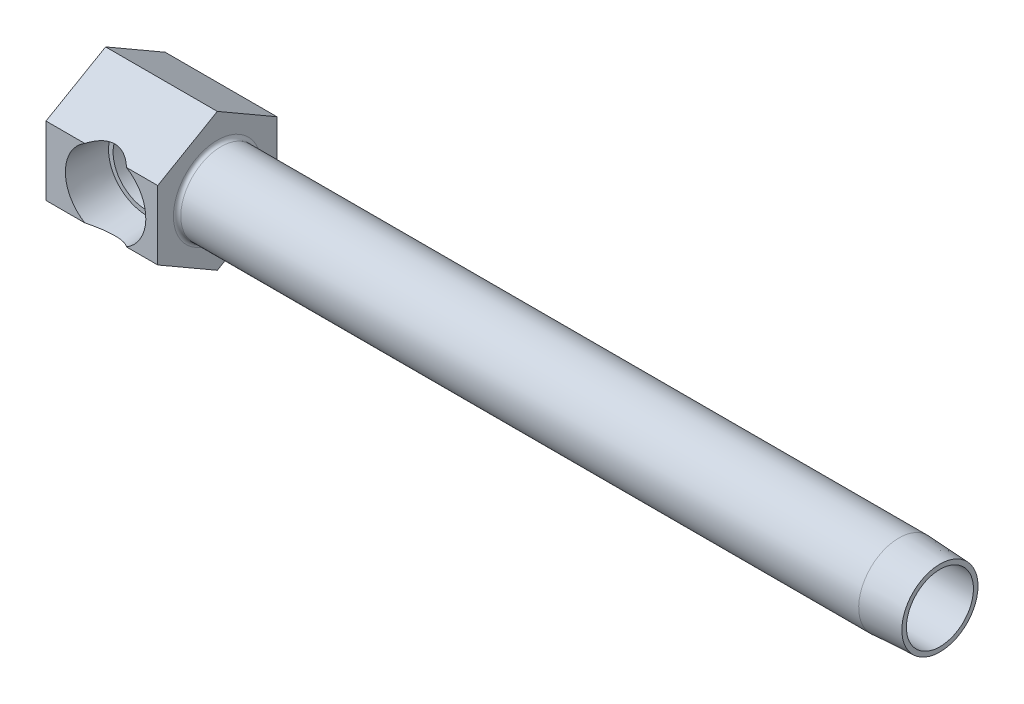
ISO-10303-21;
HEADER;
FILE_DESCRIPTION(('STEP AP214'),'2;1');
FILE_NAME('part.step','',(''),(''),'','','');
FILE_SCHEMA(('AUTOMOTIVE_DESIGN { 1 0 10303 214 1 1 1 1 }'));
ENDSEC;
DATA;
#1=APPLICATION_CONTEXT('core data for automotive mechanical design processes');
#2=APPLICATION_PROTOCOL_DEFINITION('international standard','automotive_design',2000,#1);
#3=PRODUCT_CONTEXT('',#1,'mechanical');
#4=PRODUCT('Part','Part','',(#3));
#5=PRODUCT_RELATED_PRODUCT_CATEGORY('part','',(#4));
#6=PRODUCT_DEFINITION_FORMATION('','',#4);
#7=PRODUCT_DEFINITION_CONTEXT('part definition',#1,'design');
#8=PRODUCT_DEFINITION('design','',#6,#7);
#9=PRODUCT_DEFINITION_SHAPE('','',#8);
#10=(LENGTH_UNIT() NAMED_UNIT(*) SI_UNIT(.MILLI.,.METRE.));
#11=(NAMED_UNIT(*) PLANE_ANGLE_UNIT() SI_UNIT($,.RADIAN.));
#12=(NAMED_UNIT(*) SI_UNIT($,.STERADIAN.) SOLID_ANGLE_UNIT());
#13=UNCERTAINTY_MEASURE_WITH_UNIT(LENGTH_MEASURE(1.E-05),#10,'distance_accuracy_value','');
#14=(GEOMETRIC_REPRESENTATION_CONTEXT(3) GLOBAL_UNCERTAINTY_ASSIGNED_CONTEXT((#13)) GLOBAL_UNIT_ASSIGNED_CONTEXT((#10,
#11,#12)) REPRESENTATION_CONTEXT('',''));
#15=CARTESIAN_POINT('',(0.,0.,0.));
#16=DIRECTION('',(0.,0.,1.));
#17=DIRECTION('',(1.,0.,0.));
#18=AXIS2_PLACEMENT_3D('',#15,#16,#17);
#19=CARTESIAN_POINT('',(63.5,0.,12.7));
#20=DIRECTION('',(-1.,0.,0.));
#21=DIRECTION('',(0.,-1.,0.));
#22=AXIS2_PLACEMENT_3D('',#19,#20,#21);
#23=CYLINDRICAL_SURFACE('',#22,8.5725);
#24=CARTESIAN_POINT('',(24.5999,0.,12.7));
#25=DIRECTION('',(-1.,0.,0.));
#26=DIRECTION('',(0.,-1.,0.));
#27=AXIS2_PLACEMENT_3D('',#24,#25,#26);
#28=CIRCLE('',#27,8.5725);
#29=CARTESIAN_POINT('',(24.5999,-8.57249999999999,12.7));
#30=VERTEX_POINT('',#29);
#31=EDGE_CURVE('E22',#30,#30,#28,.F.);
#32=ORIENTED_EDGE('',*,*,#31,.T.);
#33=EDGE_LOOP('',(#32));
#34=FACE_BOUND('',#33,.T.);
#35=CARTESIAN_POINT('',(169.0624,0.,12.7));
#36=DIRECTION('',(1.,0.,0.));
#37=DIRECTION('',(0.,0.,-1.));
#38=AXIS2_PLACEMENT_3D('',#35,#36,#37);
#39=CIRCLE('',#38,8.5725);
#40=CARTESIAN_POINT('',(169.0624,0.,4.1275));
#41=VERTEX_POINT('',#40);
#42=EDGE_CURVE('E153',#41,#41,#39,.T.);
#43=ORIENTED_EDGE('',*,*,#42,.F.);
#44=EDGE_LOOP('',(#43));
#45=FACE_BOUND('',#44,.T.);
#46=ADVANCED_FACE('F15',(#34,#45),#23,.T.);
#47=CARTESIAN_POINT('',(23.8125,14.6646968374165,12.7));
#48=DIRECTION('',(0.,-0.866025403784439,-0.5));
#49=DIRECTION('',(0.,0.5,-0.866025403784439));
#50=AXIS2_PLACEMENT_3D('',#47,#48,#49);
#51=PLANE('',#50);
#52=CARTESIAN_POINT('',(12.7,-0.84553451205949,39.56450873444));
#53=DIRECTION('',(0.,-0.866025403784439,-0.5));
#54=DIRECTION('',(0.,-0.5,0.866025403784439));
#55=AXIS2_PLACEMENT_3D('',#52,#53,#54);
#56=ELLIPSE('',#55,18.6296608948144,9.27637524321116);
#57=CARTESIAN_POINT('',(17.1412186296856,7.33234841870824,25.4));
#58=VERTEX_POINT('',#57);
#59=CARTESIAN_POINT('',(8.25878137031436,7.33234841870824,25.4));
#60=VERTEX_POINT('',#59);
#61=EDGE_CURVE('E232',#58,#60,#56,.F.);
#62=ORIENTED_EDGE('',*,*,#61,.F.);
#63=DIRECTION('',(-1.,0.,0.));
#64=VECTOR('',#63,1.);
#65=CARTESIAN_POINT('',(23.8125,7.33234841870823,25.4));
#66=LINE('',#65,#64);
#67=CARTESIAN_POINT('',(23.8125,7.33234841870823,25.4));
#68=VERTEX_POINT('',#67);
#69=EDGE_CURVE('E202',#68,#58,#66,.T.);
#70=ORIENTED_EDGE('',*,*,#69,.F.);
#71=DIRECTION('',(0.,-0.5,0.866025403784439));
#72=VECTOR('',#71,1.);
#73=CARTESIAN_POINT('',(23.8125,14.6646968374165,12.7));
#74=LINE('',#73,#72);
#75=CARTESIAN_POINT('',(23.8125,14.6646968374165,12.7));
#76=VERTEX_POINT('',#75);
#77=EDGE_CURVE('E222',#76,#68,#74,.T.);
#78=ORIENTED_EDGE('',*,*,#77,.F.);
#79=DIRECTION('',(-1.,0.,0.));
#80=VECTOR('',#79,1.);
#81=CARTESIAN_POINT('',(23.8125,14.6646968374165,12.7));
#82=LINE('',#81,#80);
#83=CARTESIAN_POINT('',(0.,14.6646968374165,12.7));
#84=VERTEX_POINT('',#83);
#85=EDGE_CURVE('E199',#76,#84,#82,.T.);
#86=ORIENTED_EDGE('',*,*,#85,.T.);
#87=DIRECTION('',(0.,-0.5,0.866025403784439));
#88=VECTOR('',#87,1.);
#89=CARTESIAN_POINT('',(0.,14.6646968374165,12.7));
#90=LINE('',#89,#88);
#91=CARTESIAN_POINT('',(0.,7.33234841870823,25.4));
#92=VERTEX_POINT('',#91);
#93=EDGE_CURVE('E239',#84,#92,#90,.T.);
#94=ORIENTED_EDGE('',*,*,#93,.T.);
#95=EDGE_CURVE('E205',#60,#92,#66,.T.);
#96=ORIENTED_EDGE('',*,*,#95,.F.);
#97=EDGE_LOOP('',(#62,#70,#78,#86,#94,#96));
#98=FACE_BOUND('',#97,.T.);
#99=ADVANCED_FACE('F173',(#98),#51,.F.);
#100=CARTESIAN_POINT('',(23.8125,7.33234841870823,25.4));
#101=DIRECTION('',(0.,0.,-1.));
#102=DIRECTION('',(-1.,0.,0.));
#103=AXIS2_PLACEMENT_3D('',#100,#101,#102);
#104=PLANE('',#103);
#105=CARTESIAN_POINT('',(12.7,0.,25.4));
#106=DIRECTION('',(0.,0.,-1.));
#107=DIRECTION('',(-1.,0.,0.));
#108=AXIS2_PLACEMENT_3D('',#105,#106,#107);
#109=CIRCLE('',#108,8.5725);
#110=CARTESIAN_POINT('',(17.1412186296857,-7.33234841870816,25.4));
#111=VERTEX_POINT('',#110);
#112=EDGE_CURVE('E249',#58,#111,#109,.T.);
#113=ORIENTED_EDGE('',*,*,#112,.T.);
#114=DIRECTION('',(-1.,0.,0.));
#115=VECTOR('',#114,1.);
#116=CARTESIAN_POINT('',(23.8125,-7.33234841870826,25.4));
#117=LINE('',#116,#115);
#118=CARTESIAN_POINT('',(23.8125,-7.33234841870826,25.4));
#119=VERTEX_POINT('',#118);
#120=EDGE_CURVE('E206',#119,#111,#117,.T.);
#121=ORIENTED_EDGE('',*,*,#120,.F.);
#122=DIRECTION('',(0.,-1.,0.));
#123=VECTOR('',#122,1.);
#124=CARTESIAN_POINT('',(23.8125,7.33234841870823,25.4));
#125=LINE('',#124,#123);
#126=EDGE_CURVE('E220',#68,#119,#125,.T.);
#127=ORIENTED_EDGE('',*,*,#126,.F.);
#128=ORIENTED_EDGE('',*,*,#69,.T.);
#129=EDGE_LOOP('',(#113,#121,#127,#128));
#130=FACE_BOUND('',#129,.T.);
#131=ADVANCED_FACE('F179',(#130),#104,.F.);
#132=CARTESIAN_POINT('',(8.25878137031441,-7.33234841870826,25.4));
#133=VERTEX_POINT('',#132);
#134=EDGE_CURVE('E36',#133,#60,#109,.T.);
#135=ORIENTED_EDGE('',*,*,#134,.T.);
#136=ORIENTED_EDGE('',*,*,#95,.T.);
#137=DIRECTION('',(0.,-1.,0.));
#138=VECTOR('',#137,1.);
#139=CARTESIAN_POINT('',(0.,7.33234841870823,25.4));
#140=LINE('',#139,#138);
#141=CARTESIAN_POINT('',(0.,-7.33234841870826,25.4));
#142=VERTEX_POINT('',#141);
#143=EDGE_CURVE('E235',#92,#142,#140,.T.);
#144=ORIENTED_EDGE('',*,*,#143,.T.);
#145=EDGE_CURVE('E209',#133,#142,#117,.T.);
#146=ORIENTED_EDGE('',*,*,#145,.F.);
#147=EDGE_LOOP('',(#135,#136,#144,#146));
#148=FACE_BOUND('',#147,.T.);
#149=ADVANCED_FACE('F285',(#148),#104,.F.);
#150=CARTESIAN_POINT('',(23.8125,-7.33234841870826,25.4));
#151=DIRECTION('',(0.,0.86602540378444,-0.5));
#152=DIRECTION('',(0.,0.5,0.86602540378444));
#153=AXIS2_PLACEMENT_3D('',#150,#151,#152);
#154=PLANE('',#153);
#155=CARTESIAN_POINT('',(12.7,0.845534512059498,39.5645087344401));
#156=DIRECTION('',(0.,0.86602540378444,-0.5));
#157=DIRECTION('',(0.,0.5,0.86602540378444));
#158=AXIS2_PLACEMENT_3D('',#155,#156,#157);
#159=ELLIPSE('',#158,18.6296608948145,9.27637524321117);
#160=EDGE_CURVE('E10',#133,#111,#159,.F.);
#161=ORIENTED_EDGE('',*,*,#160,.F.);
#162=ORIENTED_EDGE('',*,*,#145,.T.);
#163=DIRECTION('',(0.,-0.5,-0.86602540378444));
#164=VECTOR('',#163,1.);
#165=CARTESIAN_POINT('',(0.,-7.33234841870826,25.4));
#166=LINE('',#165,#164);
#167=CARTESIAN_POINT('',(0.,-14.6646968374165,12.7));
#168=VERTEX_POINT('',#167);
#169=EDGE_CURVE('E218',#142,#168,#166,.T.);
#170=ORIENTED_EDGE('',*,*,#169,.T.);
#171=DIRECTION('',(-1.,0.,0.));
#172=VECTOR('',#171,1.);
#173=CARTESIAN_POINT('',(23.8125,-14.6646968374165,12.7));
#174=LINE('',#173,#172);
#175=CARTESIAN_POINT('',(23.8125,-14.6646968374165,12.7));
#176=VERTEX_POINT('',#175);
#177=EDGE_CURVE('E210',#176,#168,#174,.T.);
#178=ORIENTED_EDGE('',*,*,#177,.F.);
#179=DIRECTION('',(0.,-0.5,-0.86602540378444));
#180=VECTOR('',#179,1.);
#181=CARTESIAN_POINT('',(23.8125,-7.33234841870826,25.4));
#182=LINE('',#181,#180);
#183=EDGE_CURVE('E213',#119,#176,#182,.T.);
#184=ORIENTED_EDGE('',*,*,#183,.F.);
#185=ORIENTED_EDGE('',*,*,#120,.T.);
#186=EDGE_LOOP('',(#161,#162,#170,#178,#184,#185));
#187=FACE_BOUND('',#186,.T.);
#188=ADVANCED_FACE('F281',(#187),#154,.F.);
#189=CARTESIAN_POINT('',(23.8125,-14.6646968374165,12.7));
#190=DIRECTION('',(0.,0.866025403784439,0.5));
#191=DIRECTION('',(0.,-0.5,0.866025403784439));
#192=AXIS2_PLACEMENT_3D('',#189,#190,#191);
#193=PLANE('',#192);
#194=DIRECTION('',(0.,0.5,-0.866025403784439));
#195=VECTOR('',#194,1.);
#196=CARTESIAN_POINT('',(0.,-14.6646968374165,12.7));
#197=LINE('',#196,#195);
#198=CARTESIAN_POINT('',(0.,-7.33234841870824,0.));
#199=VERTEX_POINT('',#198);
#200=EDGE_CURVE('E227',#168,#199,#197,.T.);
#201=ORIENTED_EDGE('',*,*,#200,.T.);
#202=DIRECTION('',(-1.,0.,0.));
#203=VECTOR('',#202,1.);
#204=CARTESIAN_POINT('',(23.8125,-7.33234841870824,0.));
#205=LINE('',#204,#203);
#206=CARTESIAN_POINT('',(23.8125,-7.33234841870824,0.));
#207=VERTEX_POINT('',#206);
#208=EDGE_CURVE('E191',#207,#199,#205,.T.);
#209=ORIENTED_EDGE('',*,*,#208,.F.);
#210=DIRECTION('',(0.,0.5,-0.866025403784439));
#211=VECTOR('',#210,1.);
#212=CARTESIAN_POINT('',(23.8125,-14.6646968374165,12.7));
#213=LINE('',#212,#211);
#214=EDGE_CURVE('E214',#176,#207,#213,.T.);
#215=ORIENTED_EDGE('',*,*,#214,.F.);
#216=ORIENTED_EDGE('',*,*,#177,.T.);
#217=EDGE_LOOP('',(#201,#209,#215,#216));
#218=FACE_BOUND('',#217,.T.);
#219=ADVANCED_FACE('F284',(#218),#193,.F.);
#220=CARTESIAN_POINT('',(23.8125,-7.33234841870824,0.));
#221=DIRECTION('',(0.,0.,1.));
#222=DIRECTION('',(0.,-1.,0.));
#223=AXIS2_PLACEMENT_3D('',#220,#221,#222);
#224=PLANE('',#223);
#225=DIRECTION('',(0.,1.,0.));
#226=VECTOR('',#225,1.);
#227=CARTESIAN_POINT('',(0.,-7.33234841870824,0.));
#228=LINE('',#227,#226);
#229=CARTESIAN_POINT('',(0.,7.33234841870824,0.));
#230=VERTEX_POINT('',#229);
#231=EDGE_CURVE('E231',#199,#230,#228,.T.);
#232=ORIENTED_EDGE('',*,*,#231,.T.);
#233=DIRECTION('',(-1.,0.,0.));
#234=VECTOR('',#233,1.);
#235=CARTESIAN_POINT('',(23.8125,7.33234841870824,0.));
#236=LINE('',#235,#234);
#237=CARTESIAN_POINT('',(23.8125,7.33234841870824,0.));
#238=VERTEX_POINT('',#237);
#239=EDGE_CURVE('E196',#238,#230,#236,.T.);
#240=ORIENTED_EDGE('',*,*,#239,.F.);
#241=DIRECTION('',(0.,1.,0.));
#242=VECTOR('',#241,1.);
#243=CARTESIAN_POINT('',(23.8125,-7.33234841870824,0.));
#244=LINE('',#243,#242);
#245=EDGE_CURVE('E217',#207,#238,#244,.T.);
#246=ORIENTED_EDGE('',*,*,#245,.F.);
#247=ORIENTED_EDGE('',*,*,#208,.T.);
#248=EDGE_LOOP('',(#232,#240,#246,#247));
#249=FACE_BOUND('',#248,.T.);
#250=ADVANCED_FACE('F292',(#249),#224,.F.);
#251=CARTESIAN_POINT('',(23.8125,7.33234841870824,0.));
#252=DIRECTION('',(0.,-0.866025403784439,0.5));
#253=DIRECTION('',(0.,-0.5,-0.866025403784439));
#254=AXIS2_PLACEMENT_3D('',#251,#252,#253);
#255=PLANE('',#254);
#256=DIRECTION('',(0.,0.5,0.866025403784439));
#257=VECTOR('',#256,1.);
#258=CARTESIAN_POINT('',(0.,7.33234841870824,0.));
#259=LINE('',#258,#257);
#260=EDGE_CURVE('E243',#230,#84,#259,.T.);
#261=ORIENTED_EDGE('',*,*,#260,.T.);
#262=ORIENTED_EDGE('',*,*,#85,.F.);
#263=DIRECTION('',(0.,0.5,0.866025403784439));
#264=VECTOR('',#263,1.);
#265=CARTESIAN_POINT('',(23.8125,7.33234841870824,0.));
#266=LINE('',#265,#264);
#267=EDGE_CURVE('E224',#238,#76,#266,.T.);
#268=ORIENTED_EDGE('',*,*,#267,.F.);
#269=ORIENTED_EDGE('',*,*,#239,.T.);
#270=EDGE_LOOP('',(#261,#262,#268,#269));
#271=FACE_BOUND('',#270,.T.);
#272=ADVANCED_FACE('F279',(#271),#255,.F.);
#273=CARTESIAN_POINT('',(23.8125,-21.9970452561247,25.4));
#274=DIRECTION('',(-1.,0.,0.));
#275=DIRECTION('',(0.,-1.,0.));
#276=AXIS2_PLACEMENT_3D('',#273,#274,#275);
#277=PLANE('',#276);
#278=CARTESIAN_POINT('',(23.8125,0.,12.7));
#279=DIRECTION('',(-1.,0.,0.));
#280=DIRECTION('',(0.,-1.,0.));
#281=AXIS2_PLACEMENT_3D('',#278,#279,#280);
#282=CIRCLE('',#281,9.3599);
#283=CARTESIAN_POINT('',(23.8125,-9.35989999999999,12.7));
#284=VERTEX_POINT('',#283);
#285=EDGE_CURVE('E189',#284,#284,#282,.T.);
#286=ORIENTED_EDGE('',*,*,#285,.T.);
#287=EDGE_LOOP('',(#286));
#288=FACE_BOUND('',#287,.T.);
#289=ORIENTED_EDGE('',*,*,#214,.T.);
#290=ORIENTED_EDGE('',*,*,#245,.T.);
#291=ORIENTED_EDGE('',*,*,#267,.T.);
#292=ORIENTED_EDGE('',*,*,#77,.T.);
#293=ORIENTED_EDGE('',*,*,#126,.T.);
#294=ORIENTED_EDGE('',*,*,#183,.T.);
#295=EDGE_LOOP('',(#289,#290,#291,#292,#293,#294));
#296=FACE_BOUND('',#295,.T.);
#297=ADVANCED_FACE('F275',(#288,#296),#277,.F.);
#298=CARTESIAN_POINT('',(0.,-21.9970452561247,25.4));
#299=DIRECTION('',(-1.,0.,0.));
#300=DIRECTION('',(0.,-1.,0.));
#301=AXIS2_PLACEMENT_3D('',#298,#299,#300);
#302=PLANE('',#301);
#303=ORIENTED_EDGE('',*,*,#200,.F.);
#304=ORIENTED_EDGE('',*,*,#169,.F.);
#305=ORIENTED_EDGE('',*,*,#143,.F.);
#306=ORIENTED_EDGE('',*,*,#93,.F.);
#307=ORIENTED_EDGE('',*,*,#260,.F.);
#308=ORIENTED_EDGE('',*,*,#231,.F.);
#309=EDGE_LOOP('',(#303,#304,#305,#306,#307,#308));
#310=FACE_BOUND('',#309,.T.);
#311=ADVANCED_FACE('F272',(#310),#302,.T.);
#312=CARTESIAN_POINT('',(24.5999,0.,12.7));
#313=DIRECTION('',(-1.,0.,0.));
#314=DIRECTION('',(0.,-1.,0.));
#315=AXIS2_PLACEMENT_3D('',#312,#313,#314);
#316=TOROIDAL_SURFACE('',#315,9.3599,0.7874);
#317=ORIENTED_EDGE('',*,*,#31,.F.);
#318=EDGE_LOOP('',(#317));
#319=FACE_BOUND('',#318,.T.);
#320=ORIENTED_EDGE('',*,*,#285,.F.);
#321=EDGE_LOOP('',(#320));
#322=FACE_BOUND('',#321,.T.);
#323=ADVANCED_FACE('F269',(#319,#322),#316,.F.);
#324=CARTESIAN_POINT('',(12.7,0.,25.4));
#325=DIRECTION('',(0.,0.,1.));
#326=DIRECTION('',(1.,0.,0.));
#327=AXIS2_PLACEMENT_3D('',#324,#325,#326);
#328=CONICAL_SURFACE('',#327,8.5725,0.0523598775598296);
#329=CARTESIAN_POINT('',(18.2237788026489,-5.94425228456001,16.6622));
#330=CARTESIAN_POINT('',(18.2916176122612,-5.88732299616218,16.7476009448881));
#331=CARTESIAN_POINT('',(18.3592795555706,-5.82850059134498,16.8318676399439));
#332=CARTESIAN_POINT('',(18.4939968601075,-5.70702027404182,16.9981035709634));
#333=CARTESIAN_POINT('',(18.5610521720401,-5.64436205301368,17.0800726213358));
#334=CARTESIAN_POINT('',(18.761107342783,-5.45038497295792,17.3227058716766));
#335=CARTESIAN_POINT('',(18.8927964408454,-5.31322998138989,17.479846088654));
#336=CARTESIAN_POINT('',(19.1518580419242,-5.0216447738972,17.785397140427));
#337=CARTESIAN_POINT('',(19.2791735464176,-4.8670541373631,17.933703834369));
#338=CARTESIAN_POINT('',(19.5257752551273,-4.5416930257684,18.2184184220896));
#339=CARTESIAN_POINT('',(19.6450670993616,-4.37093412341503,18.35483469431));
#340=CARTESIAN_POINT('',(19.9295445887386,-3.92497659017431,18.6779693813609));
#341=CARTESIAN_POINT('',(20.0885588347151,-3.63961711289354,18.8565618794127));
#342=CARTESIAN_POINT('',(20.3031266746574,-3.18637161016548,19.0960411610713));
#343=CARTESIAN_POINT('',(20.3705741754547,-3.03133869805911,19.1710418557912));
#344=CARTESIAN_POINT('',(20.4965477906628,-2.71316594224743,19.3107517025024));
#345=CARTESIAN_POINT('',(20.5550753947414,-2.55002745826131,19.3754625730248));
#346=CARTESIAN_POINT('',(20.6538405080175,-2.24208944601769,19.4844409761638));
#347=CARTESIAN_POINT('',(20.6955064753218,-2.09831594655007,19.5303217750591));
#348=CARTESIAN_POINT('',(20.7709604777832,-1.80624508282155,19.6132970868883));
#349=CARTESIAN_POINT('',(20.8047499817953,-1.65794856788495,19.6503932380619));
#350=CARTESIAN_POINT('',(20.8638747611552,-1.35762804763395,19.7152415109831));
#351=CARTESIAN_POINT('',(20.8892082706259,-1.20560327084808,19.7429916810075));
#352=CARTESIAN_POINT('',(20.9309344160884,-0.898862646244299,19.7886706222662));
#353=CARTESIAN_POINT('',(20.9473269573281,-0.744146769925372,19.8065992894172));
#354=CARTESIAN_POINT('',(20.9708773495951,-0.43270553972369,19.8323499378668));
#355=CARTESIAN_POINT('',(20.9780075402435,-0.275975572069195,19.8401416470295));
#356=CARTESIAN_POINT('',(20.9827943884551,0.0378027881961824,19.8453730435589));
#357=CARTESIAN_POINT('',(20.9804510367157,0.194851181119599,19.8428127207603));
#358=CARTESIAN_POINT('',(20.9663398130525,0.508011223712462,19.8273884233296));
#359=CARTESIAN_POINT('',(20.9545719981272,0.664122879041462,19.8145245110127));
#360=CARTESIAN_POINT('',(20.9218545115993,0.974205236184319,19.77873224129));
#361=CARTESIAN_POINT('',(20.9009049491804,1.12817596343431,19.755804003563));
#362=CARTESIAN_POINT('',(20.8514678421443,1.42545941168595,19.701637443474));
#363=CARTESIAN_POINT('',(20.8233975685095,1.56892578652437,19.670858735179));
#364=CARTESIAN_POINT('',(20.7597875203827,1.85215468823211,19.6010144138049));
#365=CARTESIAN_POINT('',(20.7242449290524,1.99191579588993,19.5619456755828));
#366=CARTESIAN_POINT('',(20.6072066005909,2.40450989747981,19.4330773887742));
#367=CARTESIAN_POINT('',(20.5152596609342,2.67089071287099,19.3315714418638));
#368=CARTESIAN_POINT('',(20.3408066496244,3.10208873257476,19.1379689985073));
#369=CARTESIAN_POINT('',(20.2643220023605,3.27264094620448,19.0528363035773));
#370=CARTESIAN_POINT('',(20.1020422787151,3.60309741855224,18.8714152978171));
#371=CARTESIAN_POINT('',(20.0162439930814,3.76299797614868,18.7751231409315));
#372=CARTESIAN_POINT('',(19.7465644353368,4.22699236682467,18.4708514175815));
#373=CARTESIAN_POINT('',(19.550728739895,4.51459085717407,18.2478400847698));
#374=CARTESIAN_POINT('',(19.2565333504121,4.89305951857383,17.9071622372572));
#375=CARTESIAN_POINT('',(19.1663785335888,5.00247887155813,17.8020703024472));
#376=CARTESIAN_POINT('',(18.9830153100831,5.21324568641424,17.5865045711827));
#377=CARTESIAN_POINT('',(18.8898069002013,5.31459313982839,17.4760307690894));
#378=CARTESIAN_POINT('',(18.7018932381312,5.50848003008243,17.2510129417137));
#379=CARTESIAN_POINT('',(18.6072061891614,5.60108407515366,17.1365090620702));
#380=CARTESIAN_POINT('',(18.4163909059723,5.77848578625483,16.9028222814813));
#381=CARTESIAN_POINT('',(18.320263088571,5.86328566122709,16.783640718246));
#382=CARTESIAN_POINT('',(18.2237788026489,5.94425228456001,16.6622));
#383=B_SPLINE_CURVE_WITH_KNOTS('',3,(#329,#330,#331,#332,#333,#334,#335,#336,#337,#338,#339,
#340,#341,#342,#343,#344,#345,#346,#347,#348,#349,#350,#351,#352,#353,#354,#355,#356,#357,#358,
#359,#360,#361,#362,#363,#364,#365,#366,#367,#368,#369,#370,#371,#372,#373,#374,#375,#376,#377,
#378,#379,#380,#381,#382),.UNSPECIFIED.,.F.,.F.,(4,2,2,2,2,2,2,2,2,2,2,2,2,2,2,2,2,2,2,2,2,2,2,
2,2,2,4),(0.,0.369050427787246,0.738130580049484,1.47737063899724,2.22407355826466,
2.97024599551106,4.0822255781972,4.63656388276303,5.19080950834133,5.66002823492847,
6.12915938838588,6.59838844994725,7.0676224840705,7.53825460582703,8.00888718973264,
8.47951692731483,8.95014106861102,9.3978219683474,9.8456719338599,10.7406458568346,
11.3560801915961,11.9717272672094,13.2057730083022,13.7350494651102,14.2643264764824,
14.7893227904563,15.3141700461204),.UNSPECIFIED.);
#384=CARTESIAN_POINT('',(18.2239376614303,-5.94411896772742,16.6624));
#385=VERTEX_POINT('',#384);
#386=CARTESIAN_POINT('',(18.2239376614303,5.94411896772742,16.6624));
#387=VERTEX_POINT('',#386);
#388=EDGE_CURVE('E128',#385,#387,#383,.T.);
#389=ORIENTED_EDGE('',*,*,#388,.F.);
#390=CARTESIAN_POINT('',(12.7,0.,16.6624));
#391=DIRECTION('',(0.,0.,-1.));
#392=DIRECTION('',(-1.,0.,0.));
#393=AXIS2_PLACEMENT_3D('',#390,#391,#392);
#394=CIRCLE('',#393,8.1145817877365);
#395=EDGE_CURVE('E251',#385,#387,#394,.T.);
#396=ORIENTED_EDGE('',*,*,#395,.T.);
#397=EDGE_LOOP('',(#389,#396));
#398=FACE_BOUND('',#397,.T.);
#399=ORIENTED_EDGE('',*,*,#61,.T.);
#400=ORIENTED_EDGE('',*,*,#134,.F.);
#401=ORIENTED_EDGE('',*,*,#160,.T.);
#402=ORIENTED_EDGE('',*,*,#112,.F.);
#403=EDGE_LOOP('',(#399,#400,#401,#402));
#404=FACE_BOUND('',#403,.T.);
#405=ADVANCED_FACE('F136',(#398,#404),#328,.F.);
#406=CARTESIAN_POINT('',(20.8145817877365,0.,16.6624));
#407=DIRECTION('',(0.,0.,1.));
#408=DIRECTION('',(1.,0.,0.));
#409=AXIS2_PLACEMENT_3D('',#406,#407,#408);
#410=PLANE('',#409);
#411=DIRECTION('',(1.,0.,0.));
#412=VECTOR('',#411,1.);
#413=CARTESIAN_POINT('',(66.667520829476,-5.94411896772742,16.6624));
#414=LINE('',#413,#412);
#415=CARTESIAN_POINT('',(16.6624,-5.9441189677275,16.6624));
#416=VERTEX_POINT('',#415);
#417=EDGE_CURVE('E123',#416,#385,#414,.T.);
#418=ORIENTED_EDGE('',*,*,#417,.F.);
#419=CARTESIAN_POINT('',(12.7,0.,16.6624));
#420=DIRECTION('',(0.,0.,-1.));
#421=DIRECTION('',(-1.,0.,0.));
#422=AXIS2_PLACEMENT_3D('',#419,#420,#421);
#423=CIRCLE('',#422,7.14375);
#424=CARTESIAN_POINT('',(16.6624,5.9441189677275,16.6624));
#425=VERTEX_POINT('',#424);
#426=EDGE_CURVE('E119',#416,#425,#423,.T.);
#427=ORIENTED_EDGE('',*,*,#426,.T.);
#428=DIRECTION('',(1.,0.,0.));
#429=VECTOR('',#428,1.);
#430=CARTESIAN_POINT('',(66.667520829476,5.94411896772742,16.6624));
#431=LINE('',#430,#429);
#432=EDGE_CURVE('E120',#387,#425,#431,.F.);
#433=ORIENTED_EDGE('',*,*,#432,.F.);
#434=ORIENTED_EDGE('',*,*,#395,.F.);
#435=EDGE_LOOP('',(#418,#427,#433,#434));
#436=FACE_BOUND('',#435,.T.);
#437=ADVANCED_FACE('F262',(#436),#410,.T.);
#438=CARTESIAN_POINT('',(12.7,0.,34.595573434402));
#439=DIRECTION('',(0.,0.,-1.));
#440=DIRECTION('',(-1.,0.,0.));
#441=AXIS2_PLACEMENT_3D('',#438,#439,#440);
#442=CYLINDRICAL_SURFACE('',#441,7.14375);
#443=CARTESIAN_POINT('',(12.7,0.,12.7));
#444=DIRECTION('',(0.707106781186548,0.,-0.707106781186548));
#445=DIRECTION('',(-0.707106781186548,0.,-0.707106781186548));
#446=AXIS2_PLACEMENT_3D('',#443,#444,#445);
#447=ELLIPSE('',#446,10.1027881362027,7.14375);
#448=CARTESIAN_POINT('',(12.7,7.14375,12.7));
#449=VERTEX_POINT('',#448);
#450=EDGE_CURVE('E121',#425,#449,#447,.F.);
#451=ORIENTED_EDGE('',*,*,#450,.F.);
#452=ORIENTED_EDGE('',*,*,#426,.F.);
#453=CARTESIAN_POINT('',(12.7,-7.14375,12.7));
#454=VERTEX_POINT('',#453);
#455=EDGE_CURVE('E108',#454,#416,#447,.F.);
#456=ORIENTED_EDGE('',*,*,#455,.F.);
#457=CARTESIAN_POINT('',(12.7,0.,12.7));
#458=DIRECTION('',(-0.707106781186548,0.,-0.707106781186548));
#459=DIRECTION('',(0.707106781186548,0.,-0.707106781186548));
#460=AXIS2_PLACEMENT_3D('',#457,#458,#459);
#461=ELLIPSE('',#460,10.1027881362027,7.14375);
#462=CARTESIAN_POINT('',(18.1005540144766,-4.67623570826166,7.2994459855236));
#463=VERTEX_POINT('',#462);
#464=EDGE_CURVE('E104',#463,#454,#461,.T.);
#465=ORIENTED_EDGE('',*,*,#464,.F.);
#466=CARTESIAN_POINT('',(12.7,0.,7.2994459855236));
#467=DIRECTION('',(0.,0.,-1.));
#468=DIRECTION('',(-1.,0.,0.));
#469=AXIS2_PLACEMENT_3D('',#466,#467,#468);
#470=CIRCLE('',#469,7.14375);
#471=CARTESIAN_POINT('',(18.1005540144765,4.67623570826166,7.2994459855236));
#472=VERTEX_POINT('',#471);
#473=EDGE_CURVE('E134',#463,#472,#470,.T.);
#474=ORIENTED_EDGE('',*,*,#473,.T.);
#475=EDGE_CURVE('E29',#449,#472,#461,.T.);
#476=ORIENTED_EDGE('',*,*,#475,.F.);
#477=EDGE_LOOP('',(#451,#452,#456,#465,#474,#476));
#478=FACE_BOUND('',#477,.T.);
#479=ADVANCED_FACE('F117',(#478),#442,.F.);
#480=CARTESIAN_POINT('',(12.7,0.,7.2994459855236));
#481=DIRECTION('',(0.,0.,1.));
#482=DIRECTION('',(1.,0.,0.));
#483=AXIS2_PLACEMENT_3D('',#480,#481,#482);
#484=CONICAL_SURFACE('',#483,7.14375,1.0471975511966);
#485=CARTESIAN_POINT('',(18.1008122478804,4.67646667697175,7.29964598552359));
#486=CARTESIAN_POINT('',(18.0182484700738,4.60263120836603,7.23572166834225));
#487=CARTESIAN_POINT('',(17.9383238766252,4.52571856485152,7.17175555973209));
#488=CARTESIAN_POINT('',(17.7848563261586,4.36518020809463,7.0441228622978));
#489=CARTESIAN_POINT('',(17.7113260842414,4.28154172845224,6.98045709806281));
#490=CARTESIAN_POINT('',(17.5726476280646,4.1079855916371,6.8545747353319));
#491=CARTESIAN_POINT('',(17.5074361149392,4.01812452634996,6.79235056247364));
#492=CARTESIAN_POINT('',(17.3859720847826,3.83151153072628,6.66964834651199));
#493=CARTESIAN_POINT('',(17.3297132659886,3.73476451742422,6.60916909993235));
#494=CARTESIAN_POINT('',(17.2264163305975,3.53345239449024,6.49019348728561));
#495=CARTESIAN_POINT('',(17.1794940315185,3.42880893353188,6.43172867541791));
#496=CARTESIAN_POINT('',(17.0960237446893,3.21346156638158,6.31865082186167));
#497=CARTESIAN_POINT('',(17.0594774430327,3.10275667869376,6.26403840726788));
#498=CARTESIAN_POINT('',(16.996254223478,2.87633249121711,6.15970832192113));
#499=CARTESIAN_POINT('',(16.9695794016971,2.76061213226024,6.10999169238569));
#500=CARTESIAN_POINT('',(16.9248366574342,2.52527852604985,6.01627423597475));
#501=CARTESIAN_POINT('',(16.9067703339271,2.40566455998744,5.97227447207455));
#502=CARTESIAN_POINT('',(16.872150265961,2.11917129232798,5.87557836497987));
#503=CARTESIAN_POINT('',(16.8585719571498,1.95102064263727,5.82559588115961));
#504=CARTESIAN_POINT('',(16.8395248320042,1.61106163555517,5.73806695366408));
#505=CARTESIAN_POINT('',(16.834060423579,1.43925134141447,5.70052727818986));
#506=CARTESIAN_POINT('',(16.8272216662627,1.09272483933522,5.63811598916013));
#507=CARTESIAN_POINT('',(16.8258602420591,0.918001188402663,5.61328461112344));
#508=CARTESIAN_POINT('',(16.8244844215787,0.567245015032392,5.576623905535));
#509=CARTESIAN_POINT('',(16.8244696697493,0.391212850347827,5.56479114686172));
#510=CARTESIAN_POINT('',(16.8244315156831,0.0298631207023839,5.55391234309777));
#511=CARTESIAN_POINT('',(16.8244077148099,-0.155475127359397,5.55554105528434));
#512=CARTESIAN_POINT('',(16.8245481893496,-0.525517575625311,5.57319743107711));
#513=CARTESIAN_POINT('',(16.8247125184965,-0.710221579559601,5.58922920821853));
#514=CARTESIAN_POINT('',(16.8272365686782,-1.07761401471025,5.63557061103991));
#515=CARTESIAN_POINT('',(16.8295939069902,-1.26030441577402,5.66586472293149));
#516=CARTESIAN_POINT('',(16.8402108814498,-1.62260116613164,5.74051131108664));
#517=CARTESIAN_POINT('',(16.8484676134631,-1.80220898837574,5.78485686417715));
#518=CARTESIAN_POINT('',(16.8713785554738,-2.09762253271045,5.87004472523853));
#519=CARTESIAN_POINT('',(16.8829850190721,-2.21474934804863,5.90713222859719));
#520=CARTESIAN_POINT('',(16.9127302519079,-2.44618190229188,5.98700326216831));
#521=CARTESIAN_POINT('',(16.9308663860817,-2.56048875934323,6.02978449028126));
#522=CARTESIAN_POINT('',(16.9750927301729,-2.78506409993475,6.12039584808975));
#523=CARTESIAN_POINT('',(17.0011553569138,-2.89534512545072,6.16820809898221));
#524=CARTESIAN_POINT('',(17.0623258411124,-3.11130073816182,6.26827147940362));
#525=CARTESIAN_POINT('',(17.0974329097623,-3.21697572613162,6.3205222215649));
#526=CARTESIAN_POINT('',(17.1773511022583,-3.42340093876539,6.42886299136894));
#527=CARTESIAN_POINT('',(17.2222166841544,-3.52411947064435,6.48497330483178));
#528=CARTESIAN_POINT('',(17.3212699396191,-3.71931545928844,6.59977977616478));
#529=CARTESIAN_POINT('',(17.3754591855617,-3.81379185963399,6.65847636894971));
#530=CARTESIAN_POINT('',(17.4924791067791,-3.99641031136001,6.77768652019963));
#531=CARTESIAN_POINT('',(17.5553313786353,-4.08453566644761,6.83820431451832));
#532=CARTESIAN_POINT('',(17.6884734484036,-4.25426378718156,6.96019752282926));
#533=CARTESIAN_POINT('',(17.758764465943,-4.3358654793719,7.02167309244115));
#534=CARTESIAN_POINT('',(17.8750599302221,-4.46018946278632,7.11938400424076));
#535=CARTESIAN_POINT('',(17.9190095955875,-4.5049692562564,7.15548532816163));
#536=CARTESIAN_POINT('',(18.0086324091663,-4.59230195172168,7.22760435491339));
#537=CARTESIAN_POINT('',(18.0542970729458,-4.6348638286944,7.26362172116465));
#538=CARTESIAN_POINT('',(18.1008122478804,-4.67646667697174,7.29964598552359));
#539=B_SPLINE_CURVE_WITH_KNOTS('',3,(#485,#486,#487,#488,#489,#490,#491,#492,#493,#494,#495,
#496,#497,#498,#499,#500,#501,#502,#503,#504,#505,#506,#507,#508,#509,#510,#511,#512,#513,#514,
#515,#516,#517,#518,#519,#520,#521,#522,#523,#524,#525,#526,#527,#528,#529,#530,#531,#532,#533,
#534,#535,#536,#537,#538),.UNSPECIFIED.,.F.,.F.,(4,2,2,2,2,2,2,2,2,2,2,2,2,2,2,2,2,2,2,2,2,2,2,
2,2,2,4),(0.,0.383734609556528,0.768215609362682,1.14957007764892,1.530654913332,
1.91620690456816,2.30182151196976,2.68751795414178,3.07328600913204,3.60029069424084,
4.12758157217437,4.65653172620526,5.18534222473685,5.74081422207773,6.29644491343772,
6.8514726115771,7.40622727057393,7.77616444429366,8.14595249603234,8.5144681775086,
8.8829517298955,9.25354694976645,9.62420472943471,9.99580384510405,10.3674639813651,
10.5845818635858,10.8007392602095),.UNSPECIFIED.);
#540=EDGE_CURVE('E110',#472,#463,#539,.T.);
#541=ORIENTED_EDGE('',*,*,#540,.F.);
#542=ORIENTED_EDGE('',*,*,#473,.F.);
#543=EDGE_LOOP('',(#541,#542));
#544=FACE_BOUND('',#543,.T.);
#545=CARTESIAN_POINT('',(12.7,0.,3.1750000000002));
#546=VERTEX_POINT('',#545);
#547=VERTEX_LOOP('',#546);
#548=FACE_BOUND('',#547,.T.);
#549=ADVANCED_FACE('F144',(#544,#548),#484,.F.);
#550=CARTESIAN_POINT('',(66.667520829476,0.,12.7));
#551=DIRECTION('',(1.,0.,0.));
#552=DIRECTION('',(0.,0.,-1.));
#553=AXIS2_PLACEMENT_3D('',#550,#551,#552);
#554=CYLINDRICAL_SURFACE('',#553,7.1437499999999);
#555=ORIENTED_EDGE('',*,*,#388,.T.);
#556=ORIENTED_EDGE('',*,*,#432,.T.);
#557=ORIENTED_EDGE('',*,*,#450,.T.);
#558=ORIENTED_EDGE('',*,*,#475,.T.);
#559=ORIENTED_EDGE('',*,*,#540,.T.);
#560=ORIENTED_EDGE('',*,*,#464,.T.);
#561=ORIENTED_EDGE('',*,*,#455,.T.);
#562=ORIENTED_EDGE('',*,*,#417,.T.);
#563=EDGE_LOOP('',(#555,#556,#557,#558,#559,#560,#561,#562));
#564=FACE_BOUND('',#563,.T.);
#565=CARTESIAN_POINT('',(177.8,0.,12.7));
#566=DIRECTION('',(1.,0.,0.));
#567=DIRECTION('',(0.,0.,-1.));
#568=AXIS2_PLACEMENT_3D('',#565,#566,#567);
#569=CIRCLE('',#568,7.1437499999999);
#570=CARTESIAN_POINT('',(177.8,0.,5.5562500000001));
#571=VERTEX_POINT('',#570);
#572=EDGE_CURVE('E159',#571,#571,#569,.T.);
#573=ORIENTED_EDGE('',*,*,#572,.T.);
#574=EDGE_LOOP('',(#573));
#575=FACE_BOUND('',#574,.T.);
#576=ADVANCED_FACE('F106',(#564,#575),#554,.F.);
#577=CARTESIAN_POINT('',(177.8,0.,12.7));
#578=DIRECTION('',(-1.,0.,0.));
#579=DIRECTION('',(0.,0.,1.));
#580=AXIS2_PLACEMENT_3D('',#577,#578,#579);
#581=CONICAL_SURFACE('',#580,8.11458178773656,0.052359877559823);
#582=ORIENTED_EDGE('',*,*,#42,.T.);
#583=EDGE_LOOP('',(#582));
#584=FACE_BOUND('',#583,.T.);
#585=CARTESIAN_POINT('',(177.8,0.,12.7));
#586=DIRECTION('',(1.,0.,0.));
#587=DIRECTION('',(0.,0.,-1.));
#588=AXIS2_PLACEMENT_3D('',#585,#586,#587);
#589=CIRCLE('',#588,8.11458178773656);
#590=CARTESIAN_POINT('',(177.8,0.,4.58541821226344));
#591=VERTEX_POINT('',#590);
#592=EDGE_CURVE('E156',#591,#591,#589,.T.);
#593=ORIENTED_EDGE('',*,*,#592,.F.);
#594=EDGE_LOOP('',(#593));
#595=FACE_BOUND('',#594,.T.);
#596=ADVANCED_FACE('F143',(#584,#595),#581,.T.);
#597=CARTESIAN_POINT('',(177.8,0.,5.5562500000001));
#598=DIRECTION('',(1.,0.,0.));
#599=DIRECTION('',(0.,0.,-1.));
#600=AXIS2_PLACEMENT_3D('',#597,#598,#599);
#601=PLANE('',#600);
#602=ORIENTED_EDGE('',*,*,#592,.T.);
#603=EDGE_LOOP('',(#602));
#604=FACE_BOUND('',#603,.T.);
#605=ORIENTED_EDGE('',*,*,#572,.F.);
#606=EDGE_LOOP('',(#605));
#607=FACE_BOUND('',#606,.T.);
#608=ADVANCED_FACE('F163',(#604,#607),#601,.T.);
#609=CLOSED_SHELL('',(#46,#99,#131,#149,#188,#219,#250,#272,#297,#311,#323,#405,#437,#479,#549,
#576,#596,#608));
#610=MANIFOLD_SOLID_BREP('B1',#609);
#611=ADVANCED_BREP_SHAPE_REPRESENTATION('',(#18,#610),#14);
#612=SHAPE_DEFINITION_REPRESENTATION(#9,#611);
ENDSEC;
END-ISO-10303-21;
